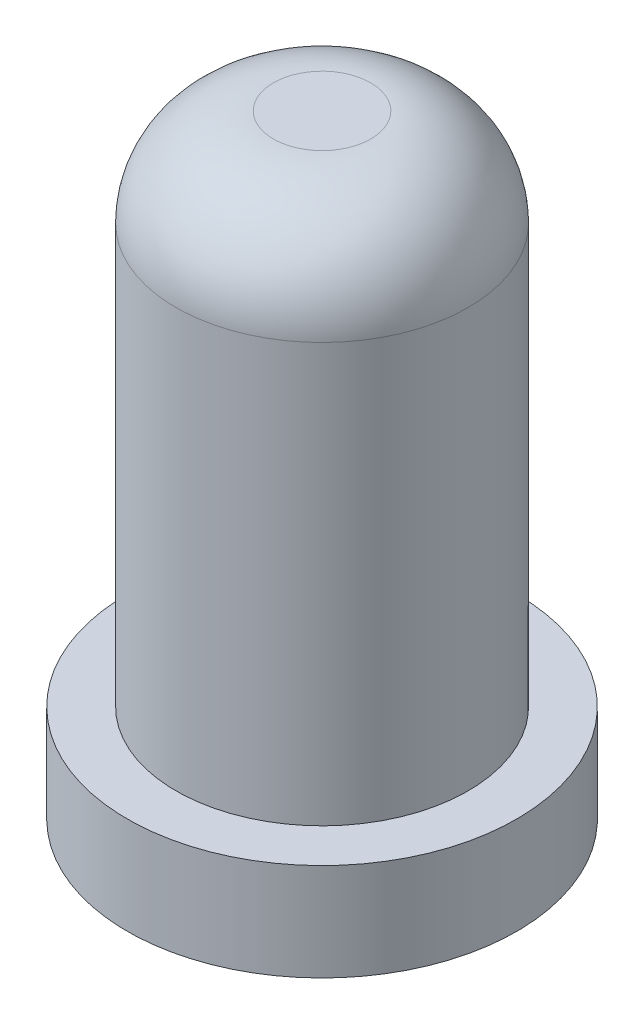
from build123d import *


with BuildPart() as part:
    # Sketch1 → Revolve1 (revolve)
    with BuildSketch(Plane.XY, mode=Mode.PRIVATE) as revolve1_sk:
        with BuildLine():
            Line((0, 0), (0, 3))
            Line((0, 3), (-0.25, 3))
            ThreePointArc((-0.25, 3), (-0.603553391, 2.853553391), (-0.75, 2.5))
            Line((-0.75, 2.5), (-0.75, 0.35))
            Line((-0.75, 0.35), (-1, 0.35))
            Line((-1, 0.35), (-1, -0.15))
            Line((-1, -0.15), (-0.75, -0.15))
            Line((-0.75, -0.15), (-0.75, 0))
            Line((-0.75, 0), (0, 0))
        make_face()
    revolve(revolve1_sk.sketch.rotate(Axis((0, 0, 0), (0, 1, 0)), 270), axis=Axis((0, 0, 0), (0, 1, 0)))


solid = part.part
